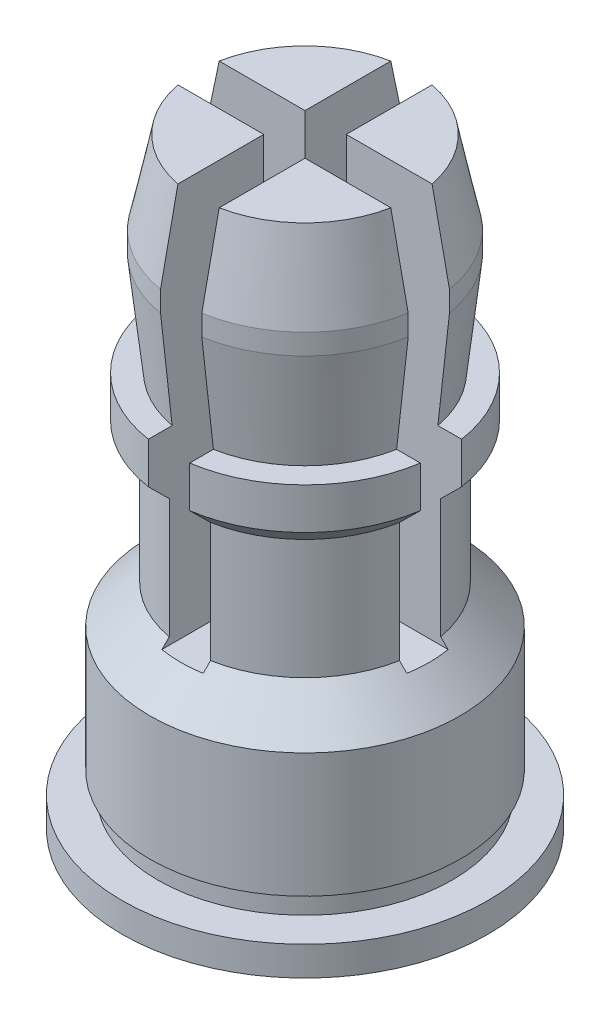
from build123d import *

# Parameters (mm, degrees)
SLITCUTSKE_W     = 5.336948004
SLITCUTSKE_H     = 0.71628
SLITCUT_DEPTH    = 6.860032
SLITCUTPAT_COUNT = 2
SLITCUTPAT_ANGLE = 90


with BuildPart() as part:
    # BodySke → Body (revolve)
    with BuildSketch(Plane.XY, mode=Mode.PRIVATE) as body_sk:
        Polygon((2.55778, 0.508), (2.55778, 0.889), (2.6924, 0.889), (2.6924, 3.043428), (2.02946, 3.706368), (2.02946, 5.78358), (2.3876, 6.14172), (2.3876, 6.858), (1.9812, 6.858), (2.17932, 8.6487), (2.17932, 9.00684), (1.88214, 10.4394), (0, 10.4394), (0, 0), (3.175, 0), (3.175, 0.508), align=None)
    revolve(body_sk.sketch.rotate(Axis((0, 0, 0), (0, 1, 0)), 90), axis=Axis((0, 0, 0), (0, 1, 0)))

    # SlitCutSke → SlitCut (cut)
    with BuildSketch(Plane(origin=(0, 10.4394, 0), x_dir=(-1, 0, 0), z_dir=(0, 1, 0))):
        Rectangle(SLITCUTSKE_W, SLITCUTSKE_H)
    slitcut = extrude(amount=-SLITCUT_DEPTH, mode=Mode.SUBTRACT)

    # SlitCutPat: SlitCut ×2 about axis
    slitcutpat_axis = Axis((0, 0, 0), (0, 1, 0))
    for i in range(1, SLITCUTPAT_COUNT):
        add(slitcut.rotate(slitcutpat_axis, i * SLITCUTPAT_ANGLE / (SLITCUTPAT_COUNT - 1)), mode=Mode.SUBTRACT)


solid = part.part
